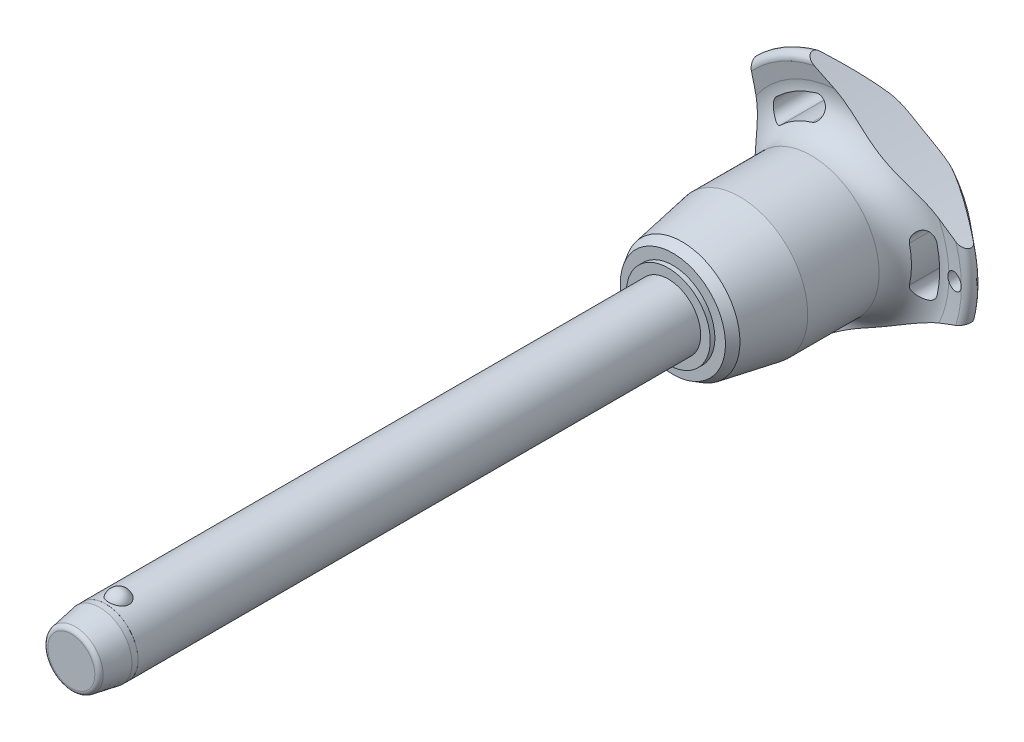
from build123d import *

# Parameters (mm, degrees)
SKETCH1_R           = 6
BOSS_EXTRUDE1_DEPTH = 100
SKETCH2_R           = 5.15
BOSS_EXTRUDE2_DEPTH = 39.7
BOSS_EXTRUDE3_START = 10.6
SKETCH1_2_R         = 6
BOSS_EXTRUDE3_DEPTH = 10.6
CHAMFER1_SIZE       = 5.3
CHAMFER1_SIZE2      = 0.934532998
FILLET1_R           = 0.85
SKETCH6_R           = 144.275
CUT_EXTRUDE1_DEPTH  = 144.700393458
CIRPATTERN1_COUNT   = 3
SKETCH7_R           = 1.5
CUT_EXTRUDE2_DEPTH  = 144.560667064
SKETCH8_R           = 6
SKETCH8_R_2         = 5.99
CUT_EXTRUDE3_DEPTH  = 6.36


with BuildPart() as part:
    # Sketch1 → Boss-Extrude1 (new body)
    with BuildSketch(Plane.XY):
        Circle(SKETCH1_R)
    extrude(amount=-BOSS_EXTRUDE1_DEPTH)

    # Sketch2 → Boss-Extrude2 (add)
    with BuildSketch(Plane(origin=(0, 0, -100), x_dir=(-1, 0, 0), z_dir=(0, 0, -1))):
        Circle(SKETCH2_R)
    extrude(amount=BOSS_EXTRUDE2_DEPTH)

    # Sketch3 → Revolve1 (revolve)
    with BuildSketch(Plane(origin=(0, 0, 0), x_dir=(0, 0, -1), z_dir=(1, 0, 0))):
        with BuildLine():
            Line((-1.854049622, 7.25), (-1.854049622, 3.25))
            ThreePointArc((-1.854049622, 3.25), (0.145950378, 5.25), (-1.854049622, 7.25))
        make_face()
        with BuildLine():
            Line((-1.854049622, -3.25), (-1.854049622, -7.25))
            ThreePointArc((-1.854049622, -7.25), (0.145950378, -5.25), (-1.854049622, -3.25))
        make_face()
    revolve(axis=Axis((0, -3.25, 1.854049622), (0, 1, 0)))

    # Sketch1_2 → Boss-Extrude3 (add)
    with BuildSketch(Plane.XY.offset(BOSS_EXTRUDE3_START)):
        Circle(SKETCH1_2_R)
    extrude(amount=-BOSS_EXTRUDE3_DEPTH)

    # Chamfer1
    chamfer1_edges = [part.edges().sort_by_distance(p)[0] for p in [
        (-6, 0, 10.6),
    ]]
    chamfer1_side = [part.faces().sort_by_distance(p)[0] for p in [
        (-6, 0, -44.7),
    ]]
    chamfer(chamfer1_edges, length=CHAMFER1_SIZE, length2=CHAMFER1_SIZE2, reference=chamfer1_side[0])

    # Fillet1
    fillet1_edges = [part.edges().sort_by_distance(p)[0] for p in [
        (-5.065467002, 0, 10.6),
        (5.15, 0, -139.7),
    ]]
    fillet(fillet1_edges, radius=FILLET1_R)

    # Sketch4 → Revolve2 (revolve)
    with BuildSketch(Plane(origin=(0, 0, 0), x_dir=(0, 0, -1), z_dir=(1, 0, 0)), mode=Mode.PRIVATE) as revolve2_sk:
        Polygon((100, 0), (100, 7.770471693), (100.85, 7.770471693), (100.85, 9.734414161), (102.550824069, 10.716385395), (113.233333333, 12.6), (126.466666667, 12.6), (126.466666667, 0), align=None)
    revolve(revolve2_sk.sketch.rotate(Axis((0, 0, -126.466666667), (0, 0, 1)), 90), axis=Axis((0, 0, -126.466666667), (0, 0, 1)))

    # Sketch5 → Revolve3 (revolve)
    with BuildSketch(Plane(origin=(0, 0, 0), x_dir=(0, 0, -1), z_dir=(1, 0, 0)), mode=Mode.PRIVATE) as revolve3_sk:
        with BuildLine():
            Line((132.379459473, 19.619255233), (131.900774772, 22.396148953))
            ThreePointArc((131.900774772, 22.396148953), (132.578274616, 23.688538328), (134.002586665, 23.371345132))
            Line((134.002586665, 23.371345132), (139.141488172, 17.247040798))
            ThreePointArc((139.141488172, 17.247040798), (139.7, 15.584758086), (138.978803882, 13.986322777))
            ThreePointArc((138.978803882, 13.986322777), (134.617427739, 7.589034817), (133.083333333, 0))
            Line((133.083333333, 0), (126.466666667, 0))
            Line((126.466666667, 0), (126.466666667, 12.6))
            ThreePointArc((126.466666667, 12.6), (131.055540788, 14.734481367), (132.379459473, 19.619255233))
        make_face()
    revolve(revolve3_sk.sketch.rotate(Axis((0, 0, -133.083333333), (0, 0, 1)), 90), axis=Axis((0, 0, -133.083333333), (0, 0, 1)))

    # Sketch6 → Cut-Extrude1 (cut, through all)
    with BuildSketch(Plane.XY):
        with Locations((-159.975, 0)):
            Circle(SKETCH6_R)
        with BuildLine():
            ThreePointArc((17.365443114, -4.192809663), (17.864441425, 0), (17.365443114, 4.192809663))
            ThreePointArc((17.365443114, 4.192809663), (15.247788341, 5.486749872), (13.953848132, 3.369095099))
            ThreePointArc((13.953848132, 3.369095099), (14.354813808, 0), (13.953848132, -3.369095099))
            ThreePointArc((13.953848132, -3.369095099), (15.247788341, -5.486749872), (17.365443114, -4.192809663))
        make_face()
    cut_extrude1 = extrude(amount=-CUT_EXTRUDE1_DEPTH, mode=Mode.SUBTRACT)

    # CirPattern1: Cut-Extrude1 ×3 about axis
    cirpattern1_axis = Axis((0, 0, 0), (0, 0, 1))
    for i in range(1, CIRPATTERN1_COUNT):
        add(cut_extrude1.rotate(cirpattern1_axis, i * 360 / CIRPATTERN1_COUNT), mode=Mode.SUBTRACT)

    # Sketch7 → Cut-Extrude2 (cut, through all)
    with BuildSketch(Plane.XY):
        with Locations(Location((20.864441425, 0, 0), (0, 0, 221.008319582))):
            Circle(SKETCH7_R)
    extrude(amount=-CUT_EXTRUDE2_DEPTH, mode=Mode.SUBTRACT)

    # Sketch8 → Cut-Extrude3 (cut)
    with BuildSketch(Plane.XY.offset(10.6)):
        Circle(SKETCH8_R)
        Circle(SKETCH8_R_2, mode=Mode.SUBTRACT)
    extrude(amount=-CUT_EXTRUDE3_DEPTH, mode=Mode.SUBTRACT)


solid = part.part
